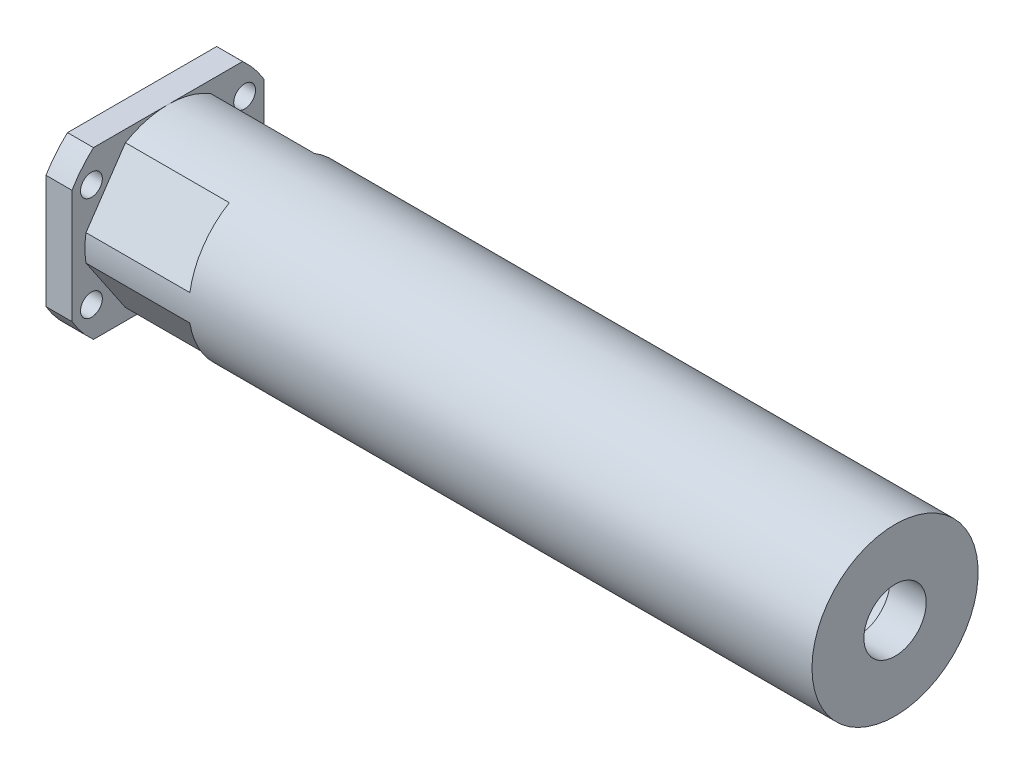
from build123d import *

# Parameters (mm, degrees)
TROU_TARAUD_M12X1_751_D = 12
ESQUISSE5_OUTSIDE_W     = 76.448
ESQUISSE5_OUTSIDE_H     = 76.448
ESQUISSE5_OUTSIDE_W_2   = 37
ESQUISSE5_OUTSIDE_H_2   = 32
ENL_V_MAT_EXTRU_2_DEPTH = 149.153636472
ESQUISSE8_OUTSIDE_W     = 69.606
ESQUISSE8_OUTSIDE_H     = 64.606
ENL_V_MAT_EXTRU_4_DEPTH = 20
ENL_V_MAT_EXTRU_5_REACH = 144.121
ESQUISSE9_R             = 2.1
ESQUISSE10_R            = 15
ESQUISSE10_R_2          = 13.25
ENL_V_MAT_EXTRU_6_DEPTH = 1.7


with BuildPart() as part:
    # Esquisse1 → R_volution1 (revolve)
    with BuildSketch(Plane.XY, mode=Mode.PRIVATE) as r_volution1_sk:
        Polygon((-138, 21.5), (-133, 21.5), (-133, 16), (7, 16), (7, 0), (0, 0), (0, 13.25), (-138, 13.25), align=None)
    revolve(r_volution1_sk.sketch.rotate(Axis((-102.774315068, 0, 0), (1, 0, 0)), 90), axis=Axis((-102.774315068, 0, 0), (1, 0, 0)))

    # Trou taraud_ M12x1.751 (through all)
    with Locations(Plane(origin=(7, 0, 0), x_dir=(0, 0, -1), z_dir=(1, 0, 0))):
        with Locations((0, 0)):
            Hole(TROU_TARAUD_M12X1_751_D / 2)

    # Esquisse5 outside → Enl_v. mat.-Extru.2 (cut, through all)
    with BuildSketch(Plane.ZY.offset(138)):
        Rectangle(ESQUISSE5_OUTSIDE_W, ESQUISSE5_OUTSIDE_H)
        Rectangle(ESQUISSE5_OUTSIDE_W_2, ESQUISSE5_OUTSIDE_H_2, mode=Mode.SUBTRACT)
    extrude(amount=-ENL_V_MAT_EXTRU_2_DEPTH, mode=Mode.SUBTRACT)

    # Esquisse8 outside → Enl_v. mat.-Extru.4 (cut)
    with BuildSketch(Plane(origin=(-133, 0, 0), x_dir=(0, 0, -1), z_dir=(1, 0, 0))):
        Rectangle(ESQUISSE8_OUTSIDE_W, ESQUISSE8_OUTSIDE_H)
        with BuildLine():
            Line((-8.206168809, 13.735311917), (-15.797377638, 2.538278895))
            ThreePointArc((-15.797377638, 2.538278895), (-16, 0), (-15.797377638, -2.538278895))
            Line((-15.797377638, -2.538278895), (-8.206168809, -13.735311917))
            ThreePointArc((-8.206168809, -13.735311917), (0.239386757, -15.998209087), (8.613455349, -13.483634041))
            Line((8.613455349, -13.483634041), (15.999436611, 0.134268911))
            ThreePointArc((15.999436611, 0.134268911), (15.943781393, 1.340087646), (15.797377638, 2.538278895))
            Line((15.797377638, 2.538278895), (8.206168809, 13.735311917))
            ThreePointArc((8.206168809, 13.735311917), (0, 16), (-8.206168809, 13.735311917))
        make_face(mode=Mode.SUBTRACT)
    extrude(amount=ENL_V_MAT_EXTRU_4_DEPTH, mode=Mode.SUBTRACT)

    # Esquisse9 → Enl_v. mat.-Extru.5 (cut, up to next)
    with BuildSketch(Plane(origin=(-133, 0, 0), x_dir=(0, 0, -1), z_dir=(1, 0, 0)), mode=Mode.PRIVATE) as enl_v_mat_extru_5_sk1:
        with Locations((-14.749765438, 9.999840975)):
            Circle(ESQUISSE9_R)
    enl_v_mat_extru_5_tool1 = extrude(enl_v_mat_extru_5_sk1.sketch, amount=-ENL_V_MAT_EXTRU_5_REACH, mode=Mode.PRIVATE) & part.part
    # Esquisse9 → Enl_v. mat.-Extru.5 (cut, up to next)
    with BuildSketch(Plane(origin=(-133, 0, 0), x_dir=(0, 0, -1), z_dir=(1, 0, 0)), mode=Mode.PRIVATE) as enl_v_mat_extru_5_sk2:
        with Locations((14.749765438, 9.999840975)):
            Circle(ESQUISSE9_R)
    enl_v_mat_extru_5_tool2 = extrude(enl_v_mat_extru_5_sk2.sketch, amount=-ENL_V_MAT_EXTRU_5_REACH, mode=Mode.PRIVATE) & part.part
    # Esquisse9 → Enl_v. mat.-Extru.5 (cut, up to next)
    with BuildSketch(Plane(origin=(-133, 0, 0), x_dir=(0, 0, -1), z_dir=(1, 0, 0)), mode=Mode.PRIVATE) as enl_v_mat_extru_5_sk3:
        with Locations((14.75, -8)):
            Circle(ESQUISSE9_R)
    enl_v_mat_extru_5_tool3 = extrude(enl_v_mat_extru_5_sk3.sketch, amount=-ENL_V_MAT_EXTRU_5_REACH, mode=Mode.PRIVATE) & part.part
    # Esquisse9 → Enl_v. mat.-Extru.5 (cut, up to next)
    with BuildSketch(Plane(origin=(-133, 0, 0), x_dir=(0, 0, -1), z_dir=(1, 0, 0)), mode=Mode.PRIVATE) as enl_v_mat_extru_5_sk4:
        with Locations((-14.749765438, -9.999840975)):
            Circle(ESQUISSE9_R)
    enl_v_mat_extru_5_tool4 = extrude(enl_v_mat_extru_5_sk4.sketch, amount=-ENL_V_MAT_EXTRU_5_REACH, mode=Mode.PRIVATE) & part.part
    add(enl_v_mat_extru_5_tool1.solids().sort_by_distance((-133, 9.999841, 14.749765))[0], mode=Mode.SUBTRACT)
    add(enl_v_mat_extru_5_tool2.solids().sort_by_distance((-133, 9.999841, -14.749765))[0], mode=Mode.SUBTRACT)
    add(enl_v_mat_extru_5_tool3.solids().sort_by_distance((-133, -8, -14.75))[0], mode=Mode.SUBTRACT)
    add(enl_v_mat_extru_5_tool4.solids().sort_by_distance((-133, -9.999841, 14.749765))[0], mode=Mode.SUBTRACT)

    # Esquisse10 → Enl_v. mat.-Extru.6 (cut)
    with BuildSketch(Plane.ZY.offset(138)):
        Circle(ESQUISSE10_R)
        Circle(ESQUISSE10_R_2, mode=Mode.SUBTRACT)
    extrude(amount=-ENL_V_MAT_EXTRU_6_DEPTH, mode=Mode.SUBTRACT)


solid = part.part
